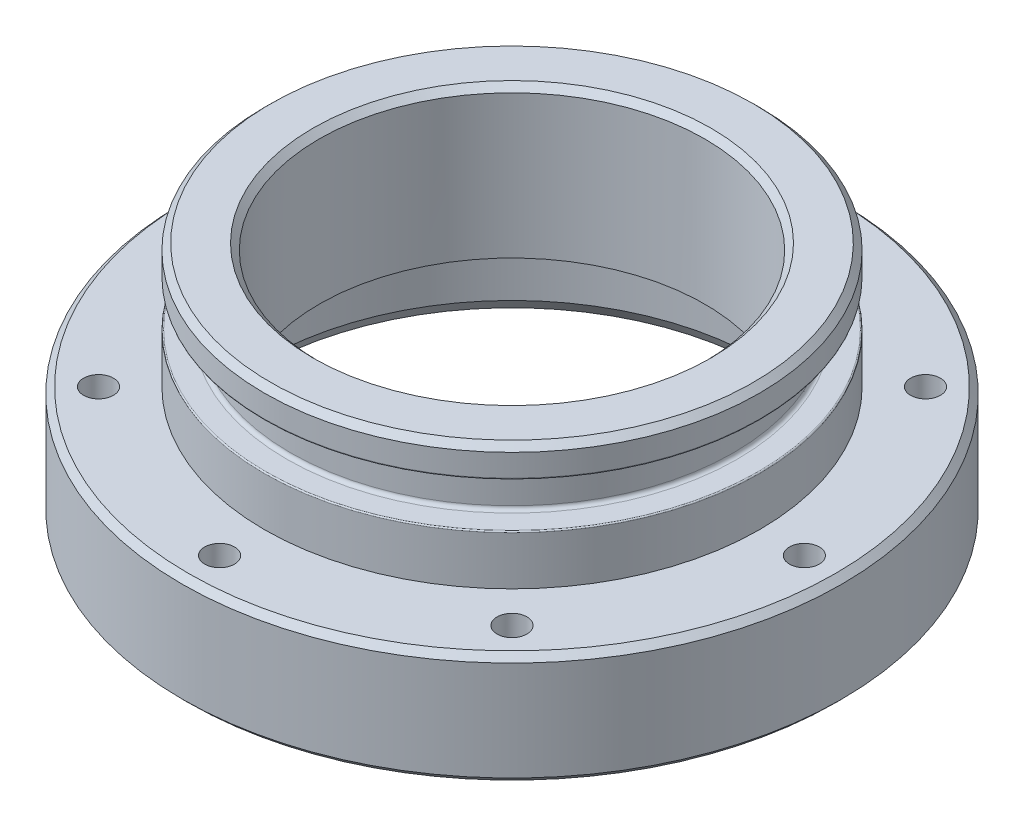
from build123d import *

# Parameters (mm, degrees)
CHAMBRAGE_POUR_VIS_T_TE_HEXAGONALE_M21_D           = 2.4
CHAMBRAGE_POUR_VIS_T_TE_HEXAGONALE_M21_CBORE_D     = 4.4
CHAMBRAGE_POUR_VIS_T_TE_HEXAGONALE_M21_CBORE_DEPTH = 2.4
ESQUISSE4_R                                        = 1.31
CHANFREIN1_SIZE                                    = 0.5
CHANFREIN2_SIZE                                    = 0.5
R_P_TITION_CIRCULAIRE1_COUNT                       = 8
CONG_1_R                                           = 0.1
CONG_2_R                                           = 0.3


with BuildPart() as part:
    # Esquisse1 → R_volution1 (revolve)
    with BuildSketch(Plane.XY, mode=Mode.PRIVATE) as r_volution1_sk:
        with BuildLine():
            Line((15.5, 19), (15.5, 7))
            Line((15.5, 7), (20, 7))
            Line((20, 7), (20, 0.866025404))
            Line((20, 0.866025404), (20.5, 0))
            Line((20.5, 0), (26.5, 0))
            Line((26.5, 0), (26.5, 9))
            Line((26.5, 9), (19.9, 9))
            Line((19.9, 9), (19.9, 13))
            Line((19.9, 13), (18.1, 13))
            ThreePointArc((18.1, 13), (17.887867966, 13.087867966), (17.8, 13.3))
            Line((17.8, 13.3), (17.8, 16.3))
            ThreePointArc((17.8, 16.3), (17.887867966, 16.512132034), (18.1, 16.6))
            Line((18.1, 16.6), (19.9, 16.6))
            Line((19.9, 16.6), (19.9, 19))
            Line((19.9, 19), (15.5, 19))
        make_face()
    revolve(r_volution1_sk.sketch.rotate(Axis((0, 15.001513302, 0), (0, -1, 0)), 90), axis=Axis((0, 15.001513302, 0), (0, -1, 0)))

    # Chambrage pour vis _ t_te hexagonale M21 (through all)
    with Locations(Plane(origin=(0, 0, 0), x_dir=(-1, 0, 0), z_dir=(0, -1, 0))):
        with Locations((0, -23.5)):
            chambrage_pour_vis_t_te_hexagonale_m21 = CounterBoreHole(CHAMBRAGE_POUR_VIS_T_TE_HEXAGONALE_M21_D / 2, CHAMBRAGE_POUR_VIS_T_TE_HEXAGONALE_M21_CBORE_D / 2, CHAMBRAGE_POUR_VIS_T_TE_HEXAGONALE_M21_CBORE_DEPTH)

    # Chanfrein1
    chanfrein1_edges = [part.edges().sort_by_distance(p)[0] for p in [
        (0, 19, -19.9),
        (0, 19, -15.5),
    ]]
    chamfer(chanfrein1_edges, length=CHANFREIN1_SIZE)

    # Chanfrein2
    chanfrein2_edges = [part.edges().sort_by_distance(p)[0] for p in [
        (0, 9, -26.5),
        (0, 0, -26.5),
    ]]
    chamfer(chanfrein2_edges, length=CHANFREIN2_SIZE)

    # R_p_tition circulaire1: Chambrage pour vis _ t_te hexagonale M21 ×8 about axis
    r_p_tition_circulaire1_axis = Axis((0, 0, 0), (0, 1, 0))
    for i in range(1, R_P_TITION_CIRCULAIRE1_COUNT):
        add(chambrage_pour_vis_t_te_hexagonale_m21.rotate(r_p_tition_circulaire1_axis, i * 360 / R_P_TITION_CIRCULAIRE1_COUNT), mode=Mode.SUBTRACT)

    # Cong_1
    cong_1_edges = [part.edges().sort_by_distance(p)[0] for p in [
        (0, 16.6, -19.9),
        (0, 13, -19.9),
    ]]
    fillet(cong_1_edges, radius=CONG_1_R)

    # Cong_2
    cong_2_edges = [part.edges().sort_by_distance(p)[0] for p in [
        (0, 7, -20),
    ]]
    fillet(cong_2_edges, radius=CONG_2_R)


with BuildPart() as body_2:
    # Esquisse4 → R_volution2 (revolve)
    with BuildSketch(Plane.XY, mode=Mode.PRIVATE) as r_volution2_sk:
        with Locations((18.605, 14.31)):
            Circle(ESQUISSE4_R)
    revolve(r_volution2_sk.sketch.rotate(Axis((0, 15.001513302, 0), (0, -1, 0)), 90), axis=Axis((0, 15.001513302, 0), (0, -1, 0)))


solid = part.part
